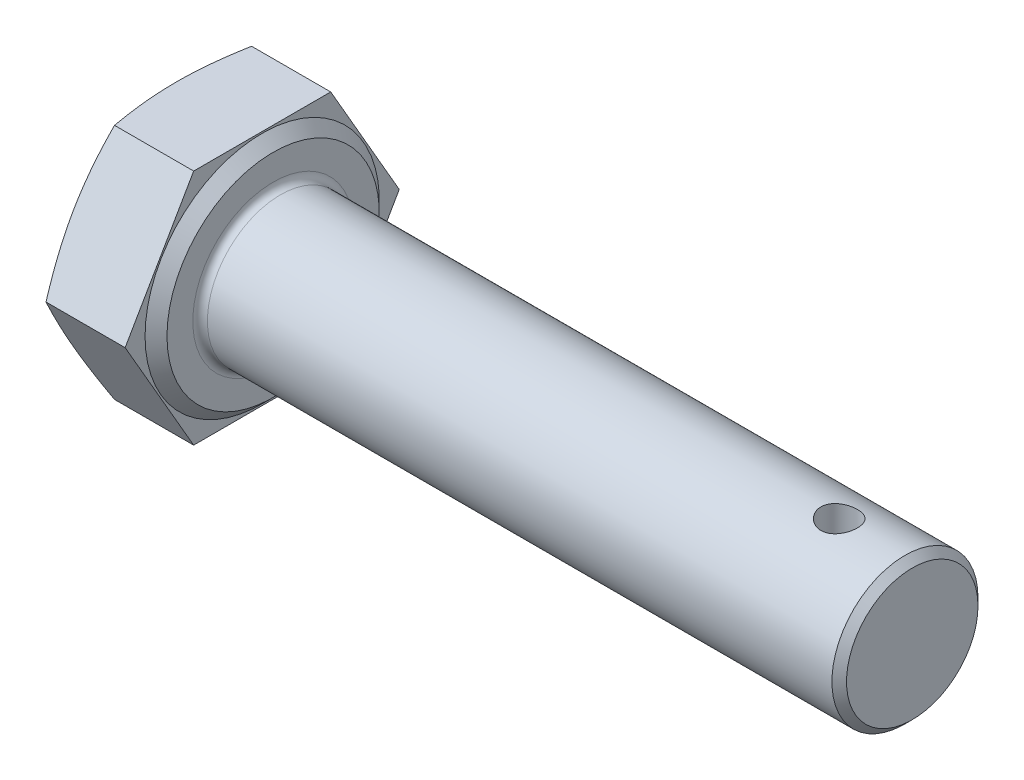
from build123d import *

# Parameters (mm, degrees)
BASEHEAD_DEPTH  = 5.3
SKETCH5_R       = 4
BASEBODY_DEPTH  = 35
CHAMFER1_SIZE   = 0.4
HOLE_DEPTH      = 42.505100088
HOLE_DEPTH_BACK = 42.505100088
SKETCH6_R       = 1
HEADFILLET_R    = 0.4


with BuildPart() as part:
    # Sketch2 → BaseHead (new body)
    with BuildSketch(Plane(origin=(0, 0, 0), x_dir=(0, 0, -1), z_dir=(1, 0, 0))):
        Polygon((7.505553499, 0), (3.75277675, 6.5), (-3.75277675, 6.5), (-7.505553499, 0), (-3.75277675, -6.5), (3.75277675, -6.5), align=None)
    extrude(amount=BASEHEAD_DEPTH)

    # Sketch3 → BearingFace (revolve, cut)
    with BuildSketch(Plane(origin=(0, 0, 0), x_dir=(1, 0, 0), z_dir=(0, 1, 0)), mode=Mode.PRIVATE) as bearingface_sk:
        Polygon((5.3, 7.505553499), (5.3, 5.815), (4.7, 6.415), (4.7, 7.505553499), align=None)
    revolve(bearingface_sk.sketch.rotate(Axis((-0.957090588, 0, 0), (1, 0, 0)), 180), axis=Axis((-0.957090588, 0, 0), (1, 0, 0)), mode=Mode.SUBTRACT)

    # Sketch4 → HeadChamfer (revolve, cut)
    with BuildSketch(Plane(origin=(0, 0, 0), x_dir=(1, 0, 0), z_dir=(0, 1, 0))):
        Polygon((0, 7.505553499), (0.365991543, 7.505553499), (0, 6.5), align=None)
    revolve(axis=Axis((-0.493528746, 0, 0), (1, 0, 0)), mode=Mode.SUBTRACT)

    # Sketch5 → BaseBody (add)
    with BuildSketch(Plane(origin=(5.3, 0, 0), x_dir=(0, 0, -1), z_dir=(1, 0, 0))):
        Circle(SKETCH5_R)
    extrude(amount=BASEBODY_DEPTH)

    # Chamfer1
    chamfer1_edges = [part.edges().sort_by_distance(p)[0] for p in [
        (40.3, 0, 4),
    ]]
    chamfer(chamfer1_edges, length=CHAMFER1_SIZE)

    # Sketch6 → Hole (cut, two sides: drawn at the far end of the back side and taken through both)
    with BuildSketch(Plane(origin=(0, 0, 0), x_dir=(1, 0, 0), z_dir=(0, 1, 0)).offset(-HOLE_DEPTH_BACK)):
        with Locations(Location((36.3, 0, 0), (0, 0, 270))):
            Circle(SKETCH6_R)
    extrude(amount=HOLE_DEPTH + HOLE_DEPTH_BACK, mode=Mode.SUBTRACT)

    # HeadFillet
    headfillet_edges = [part.edges().sort_by_distance(p)[0] for p in [
        (5.3, 0, 4),
    ]]
    fillet(headfillet_edges, radius=HEADFILLET_R)


solid = part.part
